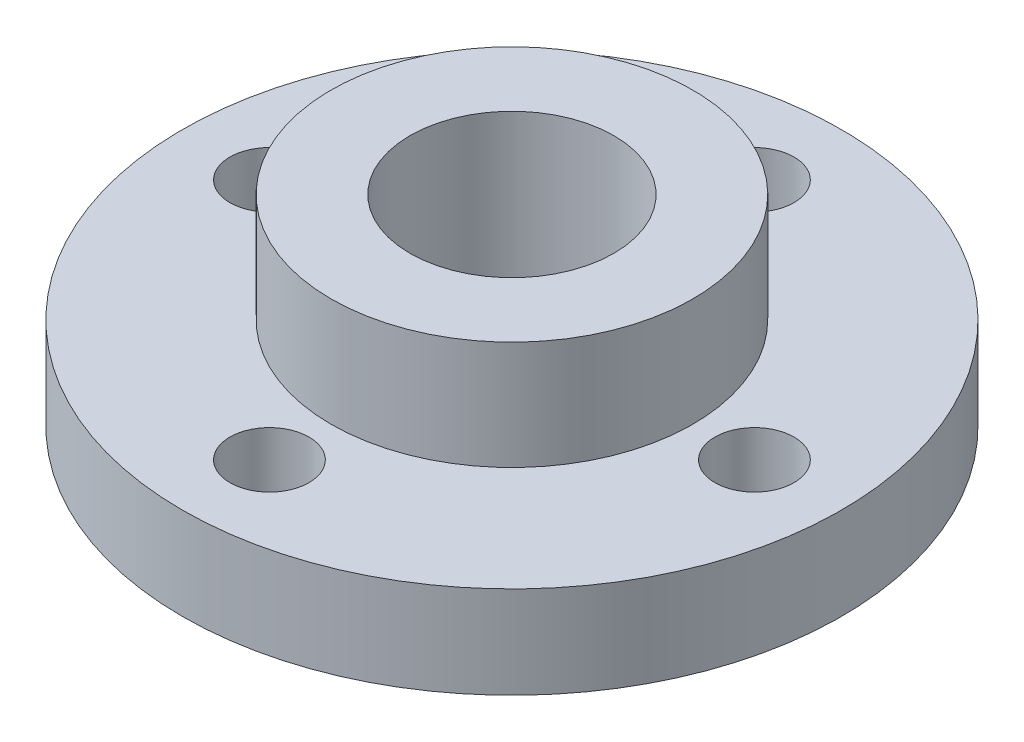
from build123d import *

# Parameters (mm, degrees)
SKETCH1_R          = 53.975
SKETCH1_R_2        = 16.7005
EXTRUDE1_DEPTH     = 15.0876
SKETCH2_R          = 6.477
CUT_EXTRUDE1_DEPTH = 15.0876
CIRPATTERN1_COUNT  = 4
SKETCH3_R          = 29.627432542
SKETCH3_R_2        = 16.7005
EXTRUDE2_DEPTH     = 17.78


with BuildPart() as part:
    # Sketch1 → Extrude1 (new body)
    with BuildSketch(Plane(origin=(0, 0, 0), x_dir=(1, 0, 0), z_dir=(0, 1, 0))):
        with Locations(Location((0, 0, 0), (0, 0, 270))):
            Circle(SKETCH1_R)
        with Locations(Location((0, 0, 0), (0, 0, 270))):
            Circle(SKETCH1_R_2, mode=Mode.SUBTRACT)
    extrude(amount=EXTRUDE1_DEPTH)

    # Sketch2 → Cut-Extrude1 (cut)
    with BuildSketch(Plane(origin=(0, 15.0876, 0), x_dir=(-1, 0, 0), z_dir=(0, 1, 0))):
        with Locations(Location((0, -39.715647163, 0), (0, 0, 90))):
            Circle(SKETCH2_R)
    cut_extrude1 = extrude(amount=-CUT_EXTRUDE1_DEPTH, mode=Mode.SUBTRACT)

    # CirPattern1: Cut-Extrude1 ×4 about axis
    cirpattern1_axis = Axis((0, 0, 0), (0, 1, 0))
    for i in range(1, CIRPATTERN1_COUNT):
        add(cut_extrude1.rotate(cirpattern1_axis, i * 360 / CIRPATTERN1_COUNT), mode=Mode.SUBTRACT)

    # Sketch3 → Extrude2 (add)
    with BuildSketch(Plane(origin=(0, 15.0876, 0), x_dir=(-1, 0, 0), z_dir=(0, 1, 0))):
        with Locations(Location((0, 0, 0), (0, 0, 90))):
            Circle(SKETCH3_R)
        with Locations(Location((0, 0, 0), (0, 0, 90))):
            Circle(SKETCH3_R_2, mode=Mode.SUBTRACT)
    extrude(amount=EXTRUDE2_DEPTH)


solid = part.part
